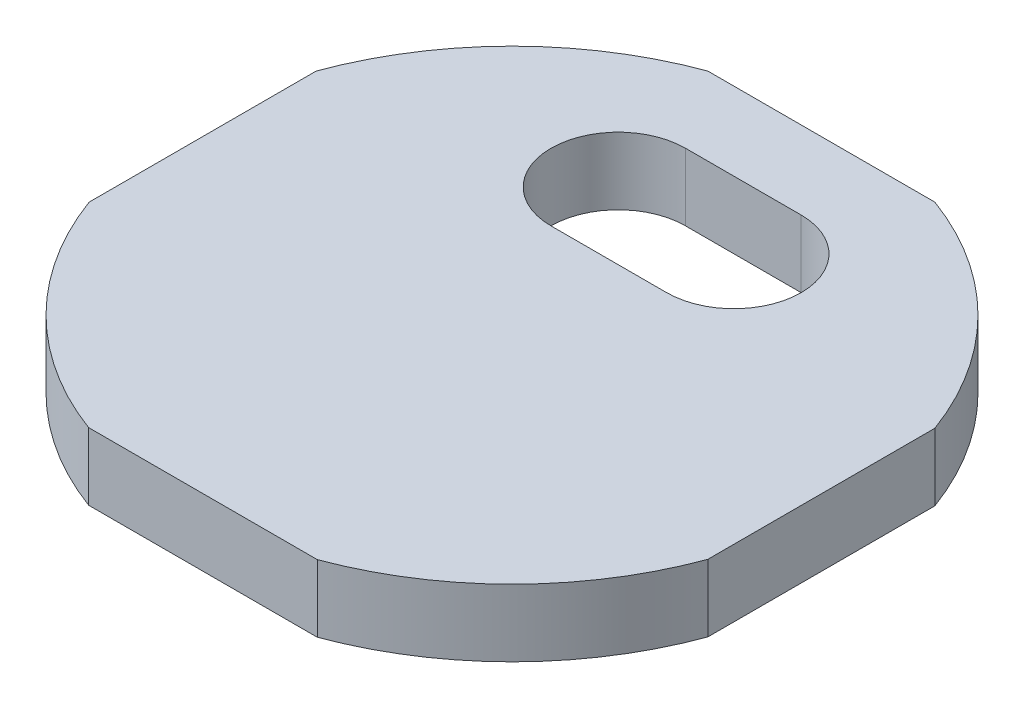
ISO-10303-21;
HEADER;
FILE_DESCRIPTION(('STEP AP214'),'2;1');
FILE_NAME('part.step','',(''),(''),'','','');
FILE_SCHEMA(('AUTOMOTIVE_DESIGN { 1 0 10303 214 1 1 1 1 }'));
ENDSEC;
DATA;
#1=APPLICATION_CONTEXT('core data for automotive mechanical design processes');
#2=APPLICATION_PROTOCOL_DEFINITION('international standard','automotive_design',2000,#1);
#3=PRODUCT_CONTEXT('',#1,'mechanical');
#4=PRODUCT('Part','Part','',(#3));
#5=PRODUCT_RELATED_PRODUCT_CATEGORY('part','',(#4));
#6=PRODUCT_DEFINITION_FORMATION('','',#4);
#7=PRODUCT_DEFINITION_CONTEXT('part definition',#1,'design');
#8=PRODUCT_DEFINITION('design','',#6,#7);
#9=PRODUCT_DEFINITION_SHAPE('','',#8);
#10=(LENGTH_UNIT() NAMED_UNIT(*) SI_UNIT(.MILLI.,.METRE.));
#11=(NAMED_UNIT(*) PLANE_ANGLE_UNIT() SI_UNIT($,.RADIAN.));
#12=(NAMED_UNIT(*) SI_UNIT($,.STERADIAN.) SOLID_ANGLE_UNIT());
#13=UNCERTAINTY_MEASURE_WITH_UNIT(LENGTH_MEASURE(1.E-05),#10,'distance_accuracy_value','');
#14=(GEOMETRIC_REPRESENTATION_CONTEXT(3) GLOBAL_UNCERTAINTY_ASSIGNED_CONTEXT((#13)) GLOBAL_UNIT_ASSIGNED_CONTEXT((#10,
#11,#12)) REPRESENTATION_CONTEXT('',''));
#15=CARTESIAN_POINT('',(0.,0.,0.));
#16=DIRECTION('',(0.,0.,1.));
#17=DIRECTION('',(1.,0.,0.));
#18=AXIS2_PLACEMENT_3D('',#15,#16,#17);
#19=CARTESIAN_POINT('',(0.,2.4,4.95549529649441));
#20=DIRECTION('',(0.,1.,0.));
#21=DIRECTION('',(0.,0.,1.));
#22=AXIS2_PLACEMENT_3D('',#19,#20,#21);
#23=PLANE('',#22);
#24=DIRECTION('',(-1.,0.,0.));
#25=VECTOR('',#24,1.);
#26=CARTESIAN_POINT('',(2.15,2.4,-8.6));
#27=LINE('',#26,#25);
#28=CARTESIAN_POINT('',(-2.15,2.4,-8.6));
#29=VERTEX_POINT('',#28);
#30=CARTESIAN_POINT('',(2.15,2.4,-8.6));
#31=VERTEX_POINT('',#30);
#32=EDGE_CURVE('E135',#29,#31,#27,.F.);
#33=ORIENTED_EDGE('',*,*,#32,.T.);
#34=CARTESIAN_POINT('',(2.15,2.4,-6.1));
#35=DIRECTION('',(0.,-1.,0.));
#36=DIRECTION('',(0.,0.,-1.));
#37=AXIS2_PLACEMENT_3D('',#34,#35,#36);
#38=CIRCLE('',#37,2.5);
#39=CARTESIAN_POINT('',(2.15,2.4,-3.6));
#40=VERTEX_POINT('',#39);
#41=EDGE_CURVE('E167',#31,#40,#38,.T.);
#42=ORIENTED_EDGE('',*,*,#41,.T.);
#43=DIRECTION('',(1.,0.,0.));
#44=VECTOR('',#43,1.);
#45=CARTESIAN_POINT('',(-2.15,2.4,-3.6));
#46=LINE('',#45,#44);
#47=CARTESIAN_POINT('',(-2.15,2.4,-3.6));
#48=VERTEX_POINT('',#47);
#49=EDGE_CURVE('E131',#40,#48,#46,.F.);
#50=ORIENTED_EDGE('',*,*,#49,.T.);
#51=CARTESIAN_POINT('',(-2.15,2.4,-6.1));
#52=DIRECTION('',(0.,-1.,0.));
#53=DIRECTION('',(0.,0.,-1.));
#54=AXIS2_PLACEMENT_3D('',#51,#52,#53);
#55=CIRCLE('',#54,2.5);
#56=EDGE_CURVE('E169',#48,#29,#55,.T.);
#57=ORIENTED_EDGE('',*,*,#56,.T.);
#58=EDGE_LOOP('',(#33,#42,#50,#57));
#59=FACE_BOUND('',#58,.T.);
#60=DIRECTION('',(0.,0.,1.));
#61=VECTOR('',#60,1.);
#62=CARTESIAN_POINT('',(-11.5,2.4,-4.220485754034));
#63=LINE('',#62,#61);
#64=CARTESIAN_POINT('',(-11.4999999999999,2.4,4.22048575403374));
#65=VERTEX_POINT('',#64);
#66=CARTESIAN_POINT('',(-11.5,2.4,-4.22048575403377));
#67=VERTEX_POINT('',#66);
#68=EDGE_CURVE('E139',#65,#67,#63,.F.);
#69=ORIENTED_EDGE('',*,*,#68,.F.);
#70=CARTESIAN_POINT('',(0.,2.4,0.));
#71=DIRECTION('',(0.,-1.,0.));
#72=DIRECTION('',(0.,0.,-1.));
#73=AXIS2_PLACEMENT_3D('',#70,#71,#72);
#74=CIRCLE('',#73,12.25);
#75=CARTESIAN_POINT('',(-4.24999999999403,2.4,11.4891252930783));
#76=VERTEX_POINT('',#75);
#77=EDGE_CURVE('E118',#76,#65,#74,.T.);
#78=ORIENTED_EDGE('',*,*,#77,.F.);
#79=DIRECTION('',(1.,0.,0.));
#80=VECTOR('',#79,1.);
#81=CARTESIAN_POINT('',(-4.25,2.4,11.48912529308));
#82=LINE('',#81,#80);
#83=CARTESIAN_POINT('',(4.24999999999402,2.4,11.4891252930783));
#84=VERTEX_POINT('',#83);
#85=EDGE_CURVE('E115',#84,#76,#82,.F.);
#86=ORIENTED_EDGE('',*,*,#85,.F.);
#87=CARTESIAN_POINT('',(0.,2.4,0.));
#88=DIRECTION('',(0.,-1.,0.));
#89=DIRECTION('',(0.,0.,-1.));
#90=AXIS2_PLACEMENT_3D('',#87,#88,#89);
#91=CIRCLE('',#90,12.25);
#92=CARTESIAN_POINT('',(11.5,2.4,4.22048575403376));
#93=VERTEX_POINT('',#92);
#94=EDGE_CURVE('E19',#93,#84,#91,.T.);
#95=ORIENTED_EDGE('',*,*,#94,.F.);
#96=DIRECTION('',(0.,0.,-1.));
#97=VECTOR('',#96,1.);
#98=CARTESIAN_POINT('',(11.5,2.4,4.220485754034));
#99=LINE('',#98,#97);
#100=CARTESIAN_POINT('',(11.4999999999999,2.4,-4.22048575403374));
#101=VERTEX_POINT('',#100);
#102=EDGE_CURVE('E102',#101,#93,#99,.F.);
#103=ORIENTED_EDGE('',*,*,#102,.F.);
#104=CARTESIAN_POINT('',(0.,2.4,0.));
#105=DIRECTION('',(0.,-1.,0.));
#106=DIRECTION('',(0.,0.,-1.));
#107=AXIS2_PLACEMENT_3D('',#104,#105,#106);
#108=CIRCLE('',#107,12.25);
#109=CARTESIAN_POINT('',(4.22048575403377,2.4,-11.5));
#110=VERTEX_POINT('',#109);
#111=EDGE_CURVE('E175',#110,#101,#108,.T.);
#112=ORIENTED_EDGE('',*,*,#111,.F.);
#113=DIRECTION('',(-1.,0.,0.));
#114=VECTOR('',#113,1.);
#115=CARTESIAN_POINT('',(4.220485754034,2.4,-11.5));
#116=LINE('',#115,#114);
#117=CARTESIAN_POINT('',(-4.22048575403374,2.4,-11.4999999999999));
#118=VERTEX_POINT('',#117);
#119=EDGE_CURVE('E143',#118,#110,#116,.F.);
#120=ORIENTED_EDGE('',*,*,#119,.F.);
#121=CARTESIAN_POINT('',(0.,2.4,0.));
#122=DIRECTION('',(0.,-1.,0.));
#123=DIRECTION('',(0.,0.,-1.));
#124=AXIS2_PLACEMENT_3D('',#121,#122,#123);
#125=CIRCLE('',#124,12.25);
#126=EDGE_CURVE('E174',#67,#118,#125,.T.);
#127=ORIENTED_EDGE('',*,*,#126,.F.);
#128=EDGE_LOOP('',(#69,#78,#86,#95,#103,#112,#120,#127));
#129=FACE_BOUND('',#128,.T.);
#130=ADVANCED_FACE('F16',(#59,#129),#23,.T.);
#131=CARTESIAN_POINT('',(-4.25,2.4,11.48912529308));
#132=DIRECTION('',(0.,0.,1.));
#133=DIRECTION('',(1.,0.,0.));
#134=AXIS2_PLACEMENT_3D('',#131,#132,#133);
#135=PLANE('',#134);
#136=ORIENTED_EDGE('',*,*,#85,.T.);
#137=DIRECTION('',(0.,-1.,0.));
#138=VECTOR('',#137,1.);
#139=CARTESIAN_POINT('',(-4.24999999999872,2.4,11.4891252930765));
#140=LINE('',#139,#138);
#141=CARTESIAN_POINT('',(-4.24999999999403,-0.0999999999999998,11.4891252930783));
#142=VERTEX_POINT('',#141);
#143=EDGE_CURVE('E173',#142,#76,#140,.F.);
#144=ORIENTED_EDGE('',*,*,#143,.F.);
#145=DIRECTION('',(1.,0.,0.));
#146=VECTOR('',#145,1.);
#147=CARTESIAN_POINT('',(0.,-0.099999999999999,11.48912529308));
#148=LINE('',#147,#146);
#149=CARTESIAN_POINT('',(4.24999999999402,-0.099999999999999,11.4891252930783));
#150=VERTEX_POINT('',#149);
#151=EDGE_CURVE('E125',#142,#150,#148,.T.);
#152=ORIENTED_EDGE('',*,*,#151,.T.);
#153=DIRECTION('',(0.,-1.,0.));
#154=VECTOR('',#153,1.);
#155=CARTESIAN_POINT('',(4.24999999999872,2.4,11.4891252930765));
#156=LINE('',#155,#154);
#157=EDGE_CURVE('E111',#84,#150,#156,.T.);
#158=ORIENTED_EDGE('',*,*,#157,.F.);
#159=EDGE_LOOP('',(#136,#144,#152,#158));
#160=FACE_BOUND('',#159,.T.);
#161=ADVANCED_FACE('F124',(#160),#135,.T.);
#162=CARTESIAN_POINT('',(0.,2.4,0.));
#163=DIRECTION('',(0.,-1.,0.));
#164=DIRECTION('',(0.,0.,-1.));
#165=AXIS2_PLACEMENT_3D('',#162,#163,#164);
#166=CYLINDRICAL_SURFACE('',#165,12.25);
#167=ORIENTED_EDGE('',*,*,#94,.T.);
#168=ORIENTED_EDGE('',*,*,#157,.T.);
#169=CARTESIAN_POINT('',(0.,-0.099999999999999,0.));
#170=DIRECTION('',(0.,-1.,0.));
#171=DIRECTION('',(0.,0.,-1.));
#172=AXIS2_PLACEMENT_3D('',#169,#170,#171);
#173=CIRCLE('',#172,12.25);
#174=CARTESIAN_POINT('',(11.5,-0.099999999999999,4.22048575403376));
#175=VERTEX_POINT('',#174);
#176=EDGE_CURVE('E165',#150,#175,#173,.F.);
#177=ORIENTED_EDGE('',*,*,#176,.T.);
#178=DIRECTION('',(0.,1.,0.));
#179=VECTOR('',#178,1.);
#180=CARTESIAN_POINT('',(11.5,2.4,4.220485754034));
#181=LINE('',#180,#179);
#182=EDGE_CURVE('E113',#93,#175,#181,.F.);
#183=ORIENTED_EDGE('',*,*,#182,.F.);
#184=EDGE_LOOP('',(#167,#168,#177,#183));
#185=FACE_BOUND('',#184,.T.);
#186=ADVANCED_FACE('F108',(#185),#166,.T.);
#187=CARTESIAN_POINT('',(11.5,2.4,4.220485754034));
#188=DIRECTION('',(1.,0.,0.));
#189=DIRECTION('',(0.,0.,-1.));
#190=AXIS2_PLACEMENT_3D('',#187,#188,#189);
#191=PLANE('',#190);
#192=ORIENTED_EDGE('',*,*,#102,.T.);
#193=ORIENTED_EDGE('',*,*,#182,.T.);
#194=DIRECTION('',(0.,0.,1.));
#195=VECTOR('',#194,1.);
#196=CARTESIAN_POINT('',(11.5,-0.099999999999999,4.95549529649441));
#197=LINE('',#196,#195);
#198=CARTESIAN_POINT('',(11.4999999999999,-0.0999999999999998,-4.22048575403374));
#199=VERTEX_POINT('',#198);
#200=EDGE_CURVE('E164',#175,#199,#197,.F.);
#201=ORIENTED_EDGE('',*,*,#200,.T.);
#202=DIRECTION('',(0.,-1.,0.));
#203=VECTOR('',#202,1.);
#204=CARTESIAN_POINT('',(11.4999999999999,2.4,-4.22048575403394));
#205=LINE('',#204,#203);
#206=EDGE_CURVE('E145',#101,#199,#205,.T.);
#207=ORIENTED_EDGE('',*,*,#206,.F.);
#208=EDGE_LOOP('',(#192,#193,#201,#207));
#209=FACE_BOUND('',#208,.T.);
#210=ADVANCED_FACE('F181',(#209),#191,.T.);
#211=CARTESIAN_POINT('',(0.,2.4,0.));
#212=DIRECTION('',(0.,-1.,0.));
#213=DIRECTION('',(0.,0.,-1.));
#214=AXIS2_PLACEMENT_3D('',#211,#212,#213);
#215=CYLINDRICAL_SURFACE('',#214,12.25);
#216=ORIENTED_EDGE('',*,*,#111,.T.);
#217=ORIENTED_EDGE('',*,*,#206,.T.);
#218=CARTESIAN_POINT('',(0.,-0.0999999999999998,0.));
#219=DIRECTION('',(0.,-1.,0.));
#220=DIRECTION('',(0.,0.,-1.));
#221=AXIS2_PLACEMENT_3D('',#218,#219,#220);
#222=CIRCLE('',#221,12.25);
#223=CARTESIAN_POINT('',(4.22048575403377,-0.0999999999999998,-11.5));
#224=VERTEX_POINT('',#223);
#225=EDGE_CURVE('E161',#199,#224,#222,.F.);
#226=ORIENTED_EDGE('',*,*,#225,.T.);
#227=DIRECTION('',(0.,1.,0.));
#228=VECTOR('',#227,1.);
#229=CARTESIAN_POINT('',(4.220485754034,2.4,-11.5));
#230=LINE('',#229,#228);
#231=EDGE_CURVE('E144',#110,#224,#230,.F.);
#232=ORIENTED_EDGE('',*,*,#231,.F.);
#233=EDGE_LOOP('',(#216,#217,#226,#232));
#234=FACE_BOUND('',#233,.T.);
#235=ADVANCED_FACE('F209',(#234),#215,.T.);
#236=CARTESIAN_POINT('',(4.220485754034,2.4,-11.5));
#237=DIRECTION('',(0.,0.,-1.));
#238=DIRECTION('',(-1.,0.,0.));
#239=AXIS2_PLACEMENT_3D('',#236,#237,#238);
#240=PLANE('',#239);
#241=ORIENTED_EDGE('',*,*,#119,.T.);
#242=ORIENTED_EDGE('',*,*,#231,.T.);
#243=DIRECTION('',(1.,0.,0.));
#244=VECTOR('',#243,1.);
#245=CARTESIAN_POINT('',(0.,-0.099999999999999,-11.5));
#246=LINE('',#245,#244);
#247=CARTESIAN_POINT('',(-4.22048575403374,-0.0999999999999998,-11.4999999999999));
#248=VERTEX_POINT('',#247);
#249=EDGE_CURVE('E160',#224,#248,#246,.F.);
#250=ORIENTED_EDGE('',*,*,#249,.T.);
#251=DIRECTION('',(0.,-1.,0.));
#252=VECTOR('',#251,1.);
#253=CARTESIAN_POINT('',(-4.22048575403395,2.4,-11.4999999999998));
#254=LINE('',#253,#252);
#255=EDGE_CURVE('E141',#118,#248,#254,.T.);
#256=ORIENTED_EDGE('',*,*,#255,.F.);
#257=EDGE_LOOP('',(#241,#242,#250,#256));
#258=FACE_BOUND('',#257,.T.);
#259=ADVANCED_FACE('F205',(#258),#240,.T.);
#260=CARTESIAN_POINT('',(0.,2.4,0.));
#261=DIRECTION('',(0.,-1.,0.));
#262=DIRECTION('',(0.,0.,-1.));
#263=AXIS2_PLACEMENT_3D('',#260,#261,#262);
#264=CYLINDRICAL_SURFACE('',#263,12.25);
#265=ORIENTED_EDGE('',*,*,#126,.T.);
#266=ORIENTED_EDGE('',*,*,#255,.T.);
#267=CARTESIAN_POINT('',(0.,-0.0999999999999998,0.));
#268=DIRECTION('',(0.,-1.,0.));
#269=DIRECTION('',(0.,0.,-1.));
#270=AXIS2_PLACEMENT_3D('',#267,#268,#269);
#271=CIRCLE('',#270,12.25);
#272=CARTESIAN_POINT('',(-11.5,-0.0999999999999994,-4.22048575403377));
#273=VERTEX_POINT('',#272);
#274=EDGE_CURVE('E157',#248,#273,#271,.F.);
#275=ORIENTED_EDGE('',*,*,#274,.T.);
#276=DIRECTION('',(0.,1.,0.));
#277=VECTOR('',#276,1.);
#278=CARTESIAN_POINT('',(-11.5,2.4,-4.220485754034));
#279=LINE('',#278,#277);
#280=EDGE_CURVE('E140',#67,#273,#279,.F.);
#281=ORIENTED_EDGE('',*,*,#280,.F.);
#282=EDGE_LOOP('',(#265,#266,#275,#281));
#283=FACE_BOUND('',#282,.T.);
#284=ADVANCED_FACE('F217',(#283),#264,.T.);
#285=CARTESIAN_POINT('',(-11.5,2.4,-4.220485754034));
#286=DIRECTION('',(-1.,0.,0.));
#287=DIRECTION('',(0.,0.,1.));
#288=AXIS2_PLACEMENT_3D('',#285,#286,#287);
#289=PLANE('',#288);
#290=ORIENTED_EDGE('',*,*,#68,.T.);
#291=ORIENTED_EDGE('',*,*,#280,.T.);
#292=DIRECTION('',(0.,0.,1.));
#293=VECTOR('',#292,1.);
#294=CARTESIAN_POINT('',(-11.5,-0.099999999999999,4.95549529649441));
#295=LINE('',#294,#293);
#296=CARTESIAN_POINT('',(-11.4999999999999,-0.0999999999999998,4.22048575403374));
#297=VERTEX_POINT('',#296);
#298=EDGE_CURVE('E156',#273,#297,#295,.T.);
#299=ORIENTED_EDGE('',*,*,#298,.T.);
#300=DIRECTION('',(0.,-1.,0.));
#301=VECTOR('',#300,1.);
#302=CARTESIAN_POINT('',(-11.4999999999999,2.4,4.22048575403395));
#303=LINE('',#302,#301);
#304=EDGE_CURVE('E171',#65,#297,#303,.T.);
#305=ORIENTED_EDGE('',*,*,#304,.F.);
#306=EDGE_LOOP('',(#290,#291,#299,#305));
#307=FACE_BOUND('',#306,.T.);
#308=ADVANCED_FACE('F245',(#307),#289,.T.);
#309=CARTESIAN_POINT('',(0.,2.4,0.));
#310=DIRECTION('',(0.,-1.,0.));
#311=DIRECTION('',(0.,0.,-1.));
#312=AXIS2_PLACEMENT_3D('',#309,#310,#311);
#313=CYLINDRICAL_SURFACE('',#312,12.25);
#314=ORIENTED_EDGE('',*,*,#77,.T.);
#315=ORIENTED_EDGE('',*,*,#304,.T.);
#316=CARTESIAN_POINT('',(0.,-0.0999999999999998,0.));
#317=DIRECTION('',(0.,-1.,0.));
#318=DIRECTION('',(0.,0.,-1.));
#319=AXIS2_PLACEMENT_3D('',#316,#317,#318);
#320=CIRCLE('',#319,12.25);
#321=EDGE_CURVE('E153',#297,#142,#320,.F.);
#322=ORIENTED_EDGE('',*,*,#321,.T.);
#323=ORIENTED_EDGE('',*,*,#143,.T.);
#324=EDGE_LOOP('',(#314,#315,#322,#323));
#325=FACE_BOUND('',#324,.T.);
#326=ADVANCED_FACE('F241',(#325),#313,.T.);
#327=CARTESIAN_POINT('',(-2.15,2.4,-6.1));
#328=DIRECTION('',(0.,-1.,0.));
#329=DIRECTION('',(0.,0.,-1.));
#330=AXIS2_PLACEMENT_3D('',#327,#328,#329);
#331=CYLINDRICAL_SURFACE('',#330,2.5);
#332=DIRECTION('',(0.,1.,0.));
#333=VECTOR('',#332,1.);
#334=CARTESIAN_POINT('',(-2.15,2.4,-8.6));
#335=LINE('',#334,#333);
#336=CARTESIAN_POINT('',(-2.15,-0.099999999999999,-8.6));
#337=VERTEX_POINT('',#336);
#338=EDGE_CURVE('E138',#337,#29,#335,.T.);
#339=ORIENTED_EDGE('',*,*,#338,.T.);
#340=ORIENTED_EDGE('',*,*,#56,.F.);
#341=DIRECTION('',(0.,1.,0.));
#342=VECTOR('',#341,1.);
#343=CARTESIAN_POINT('',(-2.15,2.4,-3.6));
#344=LINE('',#343,#342);
#345=CARTESIAN_POINT('',(-2.15,-0.099999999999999,-3.6));
#346=VERTEX_POINT('',#345);
#347=EDGE_CURVE('E134',#48,#346,#344,.F.);
#348=ORIENTED_EDGE('',*,*,#347,.T.);
#349=CARTESIAN_POINT('',(-2.15,-0.099999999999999,-6.1));
#350=DIRECTION('',(0.,-1.,0.));
#351=DIRECTION('',(0.,0.,-1.));
#352=AXIS2_PLACEMENT_3D('',#349,#350,#351);
#353=CIRCLE('',#352,2.5);
#354=EDGE_CURVE('E150',#346,#337,#353,.T.);
#355=ORIENTED_EDGE('',*,*,#354,.T.);
#356=EDGE_LOOP('',(#339,#340,#348,#355));
#357=FACE_BOUND('',#356,.T.);
#358=ADVANCED_FACE('F237',(#357),#331,.F.);
#359=CARTESIAN_POINT('',(2.15,2.4,-8.6));
#360=DIRECTION('',(0.,0.,-1.));
#361=DIRECTION('',(-1.,0.,0.));
#362=AXIS2_PLACEMENT_3D('',#359,#360,#361);
#363=PLANE('',#362);
#364=DIRECTION('',(0.,-1.,0.));
#365=VECTOR('',#364,1.);
#366=CARTESIAN_POINT('',(2.15,2.4,-8.6));
#367=LINE('',#366,#365);
#368=CARTESIAN_POINT('',(2.15,-0.099999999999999,-8.6));
#369=VERTEX_POINT('',#368);
#370=EDGE_CURVE('E137',#369,#31,#367,.F.);
#371=ORIENTED_EDGE('',*,*,#370,.T.);
#372=ORIENTED_EDGE('',*,*,#32,.F.);
#373=ORIENTED_EDGE('',*,*,#338,.F.);
#374=DIRECTION('',(1.,0.,0.));
#375=VECTOR('',#374,1.);
#376=CARTESIAN_POINT('',(0.,-0.099999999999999,-8.6));
#377=LINE('',#376,#375);
#378=EDGE_CURVE('E149',#337,#369,#377,.T.);
#379=ORIENTED_EDGE('',*,*,#378,.T.);
#380=EDGE_LOOP('',(#371,#372,#373,#379));
#381=FACE_BOUND('',#380,.T.);
#382=ADVANCED_FACE('F233',(#381),#363,.F.);
#383=CARTESIAN_POINT('',(2.15,2.4,-6.1));
#384=DIRECTION('',(0.,-1.,0.));
#385=DIRECTION('',(0.,0.,-1.));
#386=AXIS2_PLACEMENT_3D('',#383,#384,#385);
#387=CYLINDRICAL_SURFACE('',#386,2.5);
#388=DIRECTION('',(0.,1.,0.));
#389=VECTOR('',#388,1.);
#390=CARTESIAN_POINT('',(2.15,2.4,-3.6));
#391=LINE('',#390,#389);
#392=CARTESIAN_POINT('',(2.15,-0.099999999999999,-3.6));
#393=VERTEX_POINT('',#392);
#394=EDGE_CURVE('E33',#393,#40,#391,.T.);
#395=ORIENTED_EDGE('',*,*,#394,.T.);
#396=ORIENTED_EDGE('',*,*,#41,.F.);
#397=ORIENTED_EDGE('',*,*,#370,.F.);
#398=CARTESIAN_POINT('',(2.15,-0.099999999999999,-6.1));
#399=DIRECTION('',(0.,-1.,0.));
#400=DIRECTION('',(0.,0.,-1.));
#401=AXIS2_PLACEMENT_3D('',#398,#399,#400);
#402=CIRCLE('',#401,2.5);
#403=EDGE_CURVE('E25',#369,#393,#402,.T.);
#404=ORIENTED_EDGE('',*,*,#403,.T.);
#405=EDGE_LOOP('',(#395,#396,#397,#404));
#406=FACE_BOUND('',#405,.T.);
#407=ADVANCED_FACE('F227',(#406),#387,.F.);
#408=CARTESIAN_POINT('',(-2.15,2.4,-3.6));
#409=DIRECTION('',(0.,0.,1.));
#410=DIRECTION('',(1.,0.,0.));
#411=AXIS2_PLACEMENT_3D('',#408,#409,#410);
#412=PLANE('',#411);
#413=ORIENTED_EDGE('',*,*,#347,.F.);
#414=ORIENTED_EDGE('',*,*,#49,.F.);
#415=ORIENTED_EDGE('',*,*,#394,.F.);
#416=DIRECTION('',(1.,0.,0.));
#417=VECTOR('',#416,1.);
#418=CARTESIAN_POINT('',(0.,-0.099999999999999,-3.6));
#419=LINE('',#418,#417);
#420=EDGE_CURVE('E11',#393,#346,#419,.F.);
#421=ORIENTED_EDGE('',*,*,#420,.T.);
#422=EDGE_LOOP('',(#413,#414,#415,#421));
#423=FACE_BOUND('',#422,.T.);
#424=ADVANCED_FACE('F221',(#423),#412,.F.);
#425=CARTESIAN_POINT('',(0.,-0.099999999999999,4.95549529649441));
#426=DIRECTION('',(0.,1.,0.));
#427=DIRECTION('',(0.,0.,1.));
#428=AXIS2_PLACEMENT_3D('',#425,#426,#427);
#429=PLANE('',#428);
#430=ORIENTED_EDGE('',*,*,#403,.F.);
#431=ORIENTED_EDGE('',*,*,#378,.F.);
#432=ORIENTED_EDGE('',*,*,#354,.F.);
#433=ORIENTED_EDGE('',*,*,#420,.F.);
#434=EDGE_LOOP('',(#430,#431,#432,#433));
#435=FACE_BOUND('',#434,.T.);
#436=ORIENTED_EDGE('',*,*,#298,.F.);
#437=ORIENTED_EDGE('',*,*,#274,.F.);
#438=ORIENTED_EDGE('',*,*,#249,.F.);
#439=ORIENTED_EDGE('',*,*,#225,.F.);
#440=ORIENTED_EDGE('',*,*,#200,.F.);
#441=ORIENTED_EDGE('',*,*,#176,.F.);
#442=ORIENTED_EDGE('',*,*,#151,.F.);
#443=ORIENTED_EDGE('',*,*,#321,.F.);
#444=EDGE_LOOP('',(#436,#437,#438,#439,#440,#441,#442,#443));
#445=FACE_BOUND('',#444,.T.);
#446=ADVANCED_FACE('F185',(#435,#445),#429,.F.);
#447=CLOSED_SHELL('',(#130,#161,#186,#210,#235,#259,#284,#308,#326,#358,#382,#407,#424,#446));
#448=MANIFOLD_SOLID_BREP('B1',#447);
#449=ADVANCED_BREP_SHAPE_REPRESENTATION('',(#18,#448),#14);
#450=SHAPE_DEFINITION_REPRESENTATION(#9,#449);
ENDSEC;
END-ISO-10303-21;
